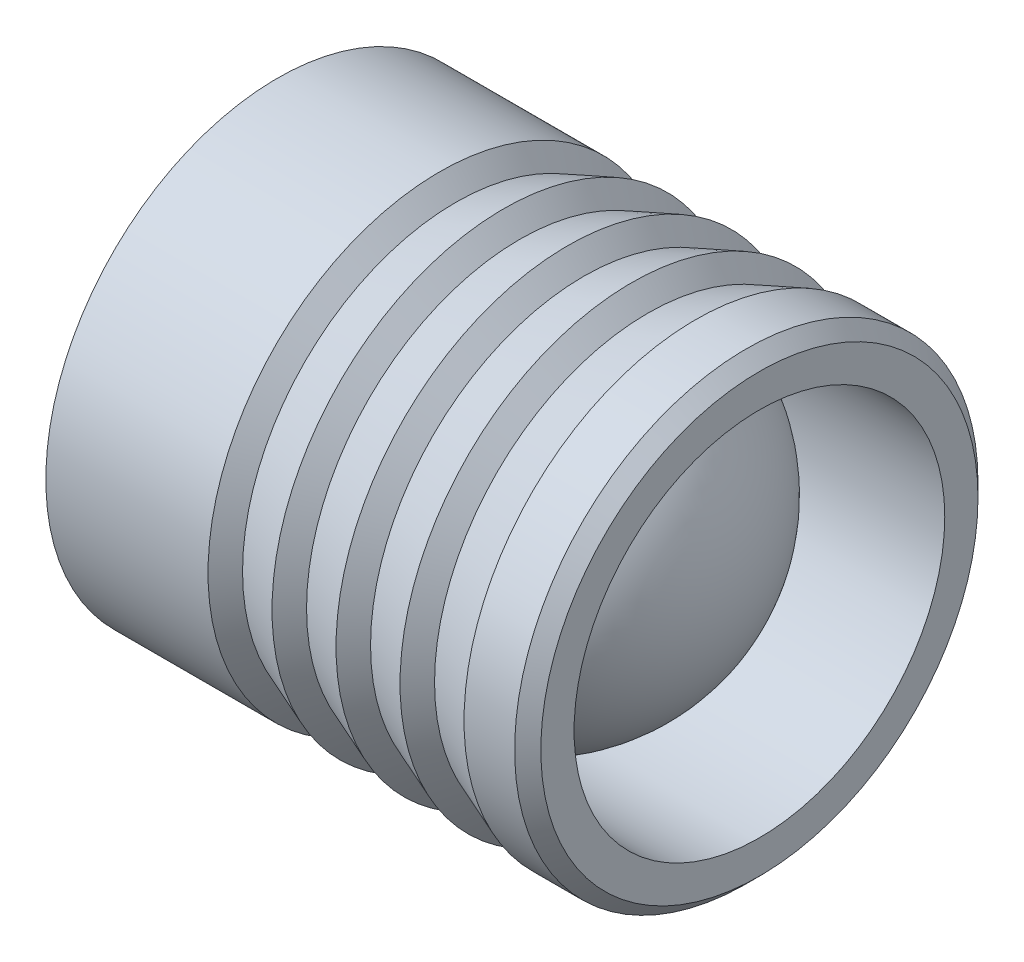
ISO-10303-21;
HEADER;
FILE_DESCRIPTION(('STEP AP214'),'2;1');
FILE_NAME('part.step','',(''),(''),'','','');
FILE_SCHEMA(('AUTOMOTIVE_DESIGN { 1 0 10303 214 1 1 1 1 }'));
ENDSEC;
DATA;
#1=APPLICATION_CONTEXT('core data for automotive mechanical design processes');
#2=APPLICATION_PROTOCOL_DEFINITION('international standard','automotive_design',2000,#1);
#3=PRODUCT_CONTEXT('',#1,'mechanical');
#4=PRODUCT('Part','Part','',(#3));
#5=PRODUCT_RELATED_PRODUCT_CATEGORY('part','',(#4));
#6=PRODUCT_DEFINITION_FORMATION('','',#4);
#7=PRODUCT_DEFINITION_CONTEXT('part definition',#1,'design');
#8=PRODUCT_DEFINITION('design','',#6,#7);
#9=PRODUCT_DEFINITION_SHAPE('','',#8);
#10=(LENGTH_UNIT() NAMED_UNIT(*) SI_UNIT(.MILLI.,.METRE.));
#11=(NAMED_UNIT(*) PLANE_ANGLE_UNIT() SI_UNIT($,.RADIAN.));
#12=(NAMED_UNIT(*) SI_UNIT($,.STERADIAN.) SOLID_ANGLE_UNIT());
#13=UNCERTAINTY_MEASURE_WITH_UNIT(LENGTH_MEASURE(1.E-05),#10,'distance_accuracy_value','');
#14=(GEOMETRIC_REPRESENTATION_CONTEXT(3) GLOBAL_UNCERTAINTY_ASSIGNED_CONTEXT((#13)) GLOBAL_UNIT_ASSIGNED_CONTEXT((#10,
#11,#12)) REPRESENTATION_CONTEXT('',''));
#15=CARTESIAN_POINT('',(0.,0.,0.));
#16=DIRECTION('',(0.,0.,1.));
#17=DIRECTION('',(1.,0.,0.));
#18=AXIS2_PLACEMENT_3D('',#15,#16,#17);
#19=CARTESIAN_POINT('',(3.09,0.,0.));
#20=DIRECTION('',(1.,0.,0.));
#21=DIRECTION('',(0.,-1.,0.));
#22=AXIS2_PLACEMENT_3D('',#19,#20,#21);
#23=SPHERICAL_SURFACE('',#22,2.01);
#24=CARTESIAN_POINT('',(3.29025084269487,0.,0.));
#25=DIRECTION('',(-1.,0.,0.));
#26=DIRECTION('',(0.,0.,1.));
#27=AXIS2_PLACEMENT_3D('',#24,#25,#26);
#28=CIRCLE('',#27,1.9999999);
#29=CARTESIAN_POINT('',(3.29025084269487,0.,1.9999999));
#30=VERTEX_POINT('',#29);
#31=EDGE_CURVE('E41',#30,#30,#28,.T.);
#32=ORIENTED_EDGE('',*,*,#31,.F.);
#33=EDGE_LOOP('',(#32));
#34=FACE_BOUND('',#33,.T.);
#35=CARTESIAN_POINT('',(5.1,0.,0.));
#36=VERTEX_POINT('',#35);
#37=VERTEX_LOOP('',#36);
#38=FACE_BOUND('',#37,.T.);
#39=ADVANCED_FACE('F18',(#34,#38),#23,.T.);
#40=CARTESIAN_POINT('',(5.5,2.35857864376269,0.));
#41=DIRECTION('',(-1.,0.,0.));
#42=DIRECTION('',(0.,0.,1.));
#43=AXIS2_PLACEMENT_3D('',#40,#41,#42);
#44=PLANE('',#43);
#45=CARTESIAN_POINT('',(5.5,0.,0.));
#46=DIRECTION('',(1.,0.,0.));
#47=DIRECTION('',(0.,0.,-1.));
#48=AXIS2_PLACEMENT_3D('',#45,#46,#47);
#49=CIRCLE('',#48,2.3585786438);
#50=CARTESIAN_POINT('',(5.5,0.,-2.35857864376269));
#51=VERTEX_POINT('',#50);
#52=EDGE_CURVE('E11',#51,#51,#49,.T.);
#53=ORIENTED_EDGE('',*,*,#52,.T.);
#54=EDGE_LOOP('',(#53));
#55=FACE_BOUND('',#54,.T.);
#56=CARTESIAN_POINT('',(5.5,0.,0.));
#57=DIRECTION('',(1.,0.,0.));
#58=DIRECTION('',(0.,0.,-1.));
#59=AXIS2_PLACEMENT_3D('',#56,#57,#58);
#60=CIRCLE('',#59,1.9999999);
#61=CARTESIAN_POINT('',(5.5,0.,-1.99999989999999));
#62=VERTEX_POINT('',#61);
#63=EDGE_CURVE('E29',#62,#62,#60,.T.);
#64=ORIENTED_EDGE('',*,*,#63,.F.);
#65=EDGE_LOOP('',(#64));
#66=FACE_BOUND('',#65,.T.);
#67=ADVANCED_FACE('F150',(#55,#66),#44,.F.);
#68=CARTESIAN_POINT('',(5.5,0.,0.));
#69=DIRECTION('',(-1.,0.,0.));
#70=DIRECTION('',(0.,0.,-1.));
#71=AXIS2_PLACEMENT_3D('',#68,#69,#70);
#72=CYLINDRICAL_SURFACE('',#71,1.9999999);
#73=ORIENTED_EDGE('',*,*,#63,.T.);
#74=EDGE_LOOP('',(#73));
#75=FACE_BOUND('',#74,.T.);
#76=ORIENTED_EDGE('',*,*,#31,.T.);
#77=EDGE_LOOP('',(#76));
#78=FACE_BOUND('',#77,.T.);
#79=ADVANCED_FACE('F141',(#75,#78),#72,.F.);
#80=CARTESIAN_POINT('',(0.,0.,0.));
#81=DIRECTION('',(1.,0.,0.));
#82=DIRECTION('',(0.,1.,0.));
#83=AXIS2_PLACEMENT_3D('',#80,#81,#82);
#84=PLANE('',#83);
#85=CARTESIAN_POINT('',(0.,0.,0.));
#86=DIRECTION('',(1.,0.,0.));
#87=DIRECTION('',(0.,0.,-1.));
#88=AXIS2_PLACEMENT_3D('',#85,#86,#87);
#89=CIRCLE('',#88,1.9803847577);
#90=CARTESIAN_POINT('',(0.,0.,-1.98038475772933));
#91=VERTEX_POINT('',#90);
#92=EDGE_CURVE('E235',#91,#91,#89,.T.);
#93=ORIENTED_EDGE('',*,*,#92,.F.);
#94=EDGE_LOOP('',(#93));
#95=FACE_BOUND('',#94,.T.);
#96=ADVANCED_FACE('F138',(#95),#84,.F.);
#97=CARTESIAN_POINT('',(5.35857864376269,0.,0.));
#98=DIRECTION('',(-1.,0.,0.));
#99=DIRECTION('',(0.,0.,1.));
#100=AXIS2_PLACEMENT_3D('',#97,#98,#99);
#101=CONICAL_SURFACE('',#100,2.5,0.7853981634);
#102=CARTESIAN_POINT('',(5.35857864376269,0.,0.));
#103=DIRECTION('',(1.,0.,0.));
#104=DIRECTION('',(0.,0.,-1.));
#105=AXIS2_PLACEMENT_3D('',#102,#103,#104);
#106=CIRCLE('',#105,2.5);
#107=CARTESIAN_POINT('',(5.35857864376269,0.,-2.5));
#108=VERTEX_POINT('',#107);
#109=EDGE_CURVE('E202',#108,#108,#106,.T.);
#110=ORIENTED_EDGE('',*,*,#109,.T.);
#111=EDGE_LOOP('',(#110));
#112=FACE_BOUND('',#111,.T.);
#113=ORIENTED_EDGE('',*,*,#52,.F.);
#114=EDGE_LOOP('',(#113));
#115=FACE_BOUND('',#114,.T.);
#116=ADVANCED_FACE('F140',(#112,#115),#101,.T.);
#117=CARTESIAN_POINT('',(5.5,0.,0.));
#118=DIRECTION('',(-1.,0.,0.));
#119=DIRECTION('',(0.,0.,-1.));
#120=AXIS2_PLACEMENT_3D('',#117,#118,#119);
#121=CYLINDRICAL_SURFACE('',#120,2.5);
#122=CARTESIAN_POINT('',(4.8125,0.,0.));
#123=DIRECTION('',(1.,0.,0.));
#124=DIRECTION('',(0.,0.,-1.));
#125=AXIS2_PLACEMENT_3D('',#122,#123,#124);
#126=CIRCLE('',#125,2.5);
#127=CARTESIAN_POINT('',(4.8125,0.,-2.5));
#128=VERTEX_POINT('',#127);
#129=EDGE_CURVE('E200',#128,#128,#126,.T.);
#130=ORIENTED_EDGE('',*,*,#129,.T.);
#131=EDGE_LOOP('',(#130));
#132=FACE_BOUND('',#131,.T.);
#133=ORIENTED_EDGE('',*,*,#109,.F.);
#134=EDGE_LOOP('',(#133));
#135=FACE_BOUND('',#134,.T.);
#136=ADVANCED_FACE('F147',(#132,#135),#121,.T.);
#137=CARTESIAN_POINT('',(4.29453125,0.,0.));
#138=DIRECTION('',(1.,0.,0.));
#139=DIRECTION('',(0.,0.,-1.));
#140=AXIS2_PLACEMENT_3D('',#137,#138,#139);
#141=CONICAL_SURFACE('',#140,2.3,0.368487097);
#142=ORIENTED_EDGE('',*,*,#129,.F.);
#143=EDGE_LOOP('',(#142));
#144=FACE_BOUND('',#143,.T.);
#145=CARTESIAN_POINT('',(4.29453125,0.,0.));
#146=DIRECTION('',(1.,0.,0.));
#147=DIRECTION('',(0.,0.,-1.));
#148=AXIS2_PLACEMENT_3D('',#145,#146,#147);
#149=CIRCLE('',#148,2.3);
#150=CARTESIAN_POINT('',(4.29453125,0.,-2.3));
#151=VERTEX_POINT('',#150);
#152=EDGE_CURVE('E210',#151,#151,#149,.T.);
#153=ORIENTED_EDGE('',*,*,#152,.T.);
#154=EDGE_LOOP('',(#153));
#155=FACE_BOUND('',#154,.T.);
#156=ADVANCED_FACE('F179',(#144,#155),#141,.T.);
#157=CARTESIAN_POINT('',(4.121875,0.,0.));
#158=DIRECTION('',(-1.,0.,0.));
#159=DIRECTION('',(0.,0.,1.));
#160=AXIS2_PLACEMENT_3D('',#157,#158,#159);
#161=CONICAL_SURFACE('',#160,2.5,0.8586421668);
#162=CARTESIAN_POINT('',(4.121875,0.,0.));
#163=DIRECTION('',(1.,0.,0.));
#164=DIRECTION('',(0.,0.,-1.));
#165=AXIS2_PLACEMENT_3D('',#162,#163,#164);
#166=CIRCLE('',#165,2.5);
#167=CARTESIAN_POINT('',(4.121875,0.,-2.5));
#168=VERTEX_POINT('',#167);
#169=EDGE_CURVE('E88',#168,#168,#166,.T.);
#170=ORIENTED_EDGE('',*,*,#169,.T.);
#171=EDGE_LOOP('',(#170));
#172=FACE_BOUND('',#171,.T.);
#173=ORIENTED_EDGE('',*,*,#152,.F.);
#174=EDGE_LOOP('',(#173));
#175=FACE_BOUND('',#174,.T.);
#176=ADVANCED_FACE('F176',(#172,#175),#161,.T.);
#177=CARTESIAN_POINT('',(3.60390625,0.,0.));
#178=DIRECTION('',(1.,0.,0.));
#179=DIRECTION('',(0.,0.,-1.));
#180=AXIS2_PLACEMENT_3D('',#177,#178,#179);
#181=CONICAL_SURFACE('',#180,2.3,0.368487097);
#182=ORIENTED_EDGE('',*,*,#169,.F.);
#183=EDGE_LOOP('',(#182));
#184=FACE_BOUND('',#183,.T.);
#185=CARTESIAN_POINT('',(3.60390625,0.,0.));
#186=DIRECTION('',(1.,0.,0.));
#187=DIRECTION('',(0.,0.,-1.));
#188=AXIS2_PLACEMENT_3D('',#185,#186,#187);
#189=CIRCLE('',#188,2.3);
#190=CARTESIAN_POINT('',(3.60390625,0.,-2.3));
#191=VERTEX_POINT('',#190);
#192=EDGE_CURVE('E95',#191,#191,#189,.T.);
#193=ORIENTED_EDGE('',*,*,#192,.T.);
#194=EDGE_LOOP('',(#193));
#195=FACE_BOUND('',#194,.T.);
#196=ADVANCED_FACE('F136',(#184,#195),#181,.T.);
#197=CARTESIAN_POINT('',(3.43125,0.,0.));
#198=DIRECTION('',(-1.,0.,0.));
#199=DIRECTION('',(0.,0.,1.));
#200=AXIS2_PLACEMENT_3D('',#197,#198,#199);
#201=CONICAL_SURFACE('',#200,2.5,0.8586421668);
#202=CARTESIAN_POINT('',(3.43125,0.,0.));
#203=DIRECTION('',(1.,0.,0.));
#204=DIRECTION('',(0.,0.,-1.));
#205=AXIS2_PLACEMENT_3D('',#202,#203,#204);
#206=CIRCLE('',#205,2.5);
#207=CARTESIAN_POINT('',(3.43125,0.,-2.5));
#208=VERTEX_POINT('',#207);
#209=EDGE_CURVE('E105',#208,#208,#206,.T.);
#210=ORIENTED_EDGE('',*,*,#209,.T.);
#211=EDGE_LOOP('',(#210));
#212=FACE_BOUND('',#211,.T.);
#213=ORIENTED_EDGE('',*,*,#192,.F.);
#214=EDGE_LOOP('',(#213));
#215=FACE_BOUND('',#214,.T.);
#216=ADVANCED_FACE('F175',(#212,#215),#201,.T.);
#217=CARTESIAN_POINT('',(2.91328125,0.,0.));
#218=DIRECTION('',(1.,0.,0.));
#219=DIRECTION('',(0.,0.,-1.));
#220=AXIS2_PLACEMENT_3D('',#217,#218,#219);
#221=CONICAL_SURFACE('',#220,2.3,0.368487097);
#222=ORIENTED_EDGE('',*,*,#209,.F.);
#223=EDGE_LOOP('',(#222));
#224=FACE_BOUND('',#223,.T.);
#225=CARTESIAN_POINT('',(2.91328125,0.,0.));
#226=DIRECTION('',(1.,0.,0.));
#227=DIRECTION('',(0.,0.,-1.));
#228=AXIS2_PLACEMENT_3D('',#225,#226,#227);
#229=CIRCLE('',#228,2.3);
#230=CARTESIAN_POINT('',(2.91328125,0.,-2.3));
#231=VERTEX_POINT('',#230);
#232=EDGE_CURVE('E221',#231,#231,#229,.T.);
#233=ORIENTED_EDGE('',*,*,#232,.T.);
#234=EDGE_LOOP('',(#233));
#235=FACE_BOUND('',#234,.T.);
#236=ADVANCED_FACE('F171',(#224,#235),#221,.T.);
#237=CARTESIAN_POINT('',(2.740625,0.,0.));
#238=DIRECTION('',(-1.,0.,0.));
#239=DIRECTION('',(0.,0.,1.));
#240=AXIS2_PLACEMENT_3D('',#237,#238,#239);
#241=CONICAL_SURFACE('',#240,2.5,0.8586421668);
#242=CARTESIAN_POINT('',(2.740625,0.,0.));
#243=DIRECTION('',(1.,0.,0.));
#244=DIRECTION('',(0.,0.,-1.));
#245=AXIS2_PLACEMENT_3D('',#242,#243,#244);
#246=CIRCLE('',#245,2.5);
#247=CARTESIAN_POINT('',(2.740625,0.,-2.5));
#248=VERTEX_POINT('',#247);
#249=EDGE_CURVE('E225',#248,#248,#246,.T.);
#250=ORIENTED_EDGE('',*,*,#249,.T.);
#251=EDGE_LOOP('',(#250));
#252=FACE_BOUND('',#251,.T.);
#253=ORIENTED_EDGE('',*,*,#232,.F.);
#254=EDGE_LOOP('',(#253));
#255=FACE_BOUND('',#254,.T.);
#256=ADVANCED_FACE('F174',(#252,#255),#241,.T.);
#257=CARTESIAN_POINT('',(2.22265625,0.,0.));
#258=DIRECTION('',(1.,0.,0.));
#259=DIRECTION('',(0.,0.,-1.));
#260=AXIS2_PLACEMENT_3D('',#257,#258,#259);
#261=CONICAL_SURFACE('',#260,2.3,0.368487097);
#262=ORIENTED_EDGE('',*,*,#249,.F.);
#263=EDGE_LOOP('',(#262));
#264=FACE_BOUND('',#263,.T.);
#265=CARTESIAN_POINT('',(2.22265625,0.,0.));
#266=DIRECTION('',(1.,0.,0.));
#267=DIRECTION('',(0.,0.,-1.));
#268=AXIS2_PLACEMENT_3D('',#265,#266,#267);
#269=CIRCLE('',#268,2.3);
#270=CARTESIAN_POINT('',(2.22265625,0.,-2.3));
#271=VERTEX_POINT('',#270);
#272=EDGE_CURVE('E22',#271,#271,#269,.T.);
#273=ORIENTED_EDGE('',*,*,#272,.T.);
#274=EDGE_LOOP('',(#273));
#275=FACE_BOUND('',#274,.T.);
#276=ADVANCED_FACE('F169',(#264,#275),#261,.T.);
#277=CARTESIAN_POINT('',(2.05,0.,0.));
#278=DIRECTION('',(-1.,0.,0.));
#279=DIRECTION('',(0.,0.,1.));
#280=AXIS2_PLACEMENT_3D('',#277,#278,#279);
#281=CONICAL_SURFACE('',#280,2.5,0.8586421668);
#282=CARTESIAN_POINT('',(2.05,0.,0.));
#283=DIRECTION('',(1.,0.,0.));
#284=DIRECTION('',(0.,0.,-1.));
#285=AXIS2_PLACEMENT_3D('',#282,#283,#284);
#286=CIRCLE('',#285,2.5);
#287=CARTESIAN_POINT('',(2.05,0.,-2.5));
#288=VERTEX_POINT('',#287);
#289=EDGE_CURVE('E226',#288,#288,#286,.T.);
#290=ORIENTED_EDGE('',*,*,#289,.T.);
#291=EDGE_LOOP('',(#290));
#292=FACE_BOUND('',#291,.T.);
#293=ORIENTED_EDGE('',*,*,#272,.F.);
#294=EDGE_LOOP('',(#293));
#295=FACE_BOUND('',#294,.T.);
#296=ADVANCED_FACE('F166',(#292,#295),#281,.T.);
#297=CARTESIAN_POINT('',(5.5,0.,0.));
#298=DIRECTION('',(-1.,0.,0.));
#299=DIRECTION('',(0.,0.,-1.));
#300=AXIS2_PLACEMENT_3D('',#297,#298,#299);
#301=CYLINDRICAL_SURFACE('',#300,2.5);
#302=CARTESIAN_POINT('',(0.3,0.,0.));
#303=DIRECTION('',(1.,0.,0.));
#304=DIRECTION('',(0.,0.,-1.));
#305=AXIS2_PLACEMENT_3D('',#302,#303,#304);
#306=CIRCLE('',#305,2.5);
#307=CARTESIAN_POINT('',(0.3,0.,-2.5));
#308=VERTEX_POINT('',#307);
#309=EDGE_CURVE('E230',#308,#308,#306,.T.);
#310=ORIENTED_EDGE('',*,*,#309,.T.);
#311=EDGE_LOOP('',(#310));
#312=FACE_BOUND('',#311,.T.);
#313=ORIENTED_EDGE('',*,*,#289,.F.);
#314=EDGE_LOOP('',(#313));
#315=FACE_BOUND('',#314,.T.);
#316=ADVANCED_FACE('F20',(#312,#315),#301,.T.);
#317=CARTESIAN_POINT('',(0.,0.,0.));
#318=DIRECTION('',(1.,0.,0.));
#319=DIRECTION('',(0.,0.,-1.));
#320=AXIS2_PLACEMENT_3D('',#317,#318,#319);
#321=CONICAL_SURFACE('',#320,1.9803847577,1.0471975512);
#322=ORIENTED_EDGE('',*,*,#309,.F.);
#323=EDGE_LOOP('',(#322));
#324=FACE_BOUND('',#323,.T.);
#325=ORIENTED_EDGE('',*,*,#92,.T.);
#326=EDGE_LOOP('',(#325));
#327=FACE_BOUND('',#326,.T.);
#328=ADVANCED_FACE('F162',(#324,#327),#321,.T.);
#329=CLOSED_SHELL('',(#39,#67,#79,#96,#116,#136,#156,#176,#196,#216,#236,#256,#276,#296,#316,#328));
#330=CARTESIAN_POINT('',(1.42970048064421,0.,0.));
#331=DIRECTION('',(1.,0.,0.));
#332=DIRECTION('',(0.,0.,-1.));
#333=AXIS2_PLACEMENT_3D('',#330,#331,#332);
#334=CONICAL_SURFACE('',#333,1.9999999,1.0471975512);
#335=CARTESIAN_POINT('',(1.42970048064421,0.,0.));
#336=DIRECTION('',(1.,0.,0.));
#337=DIRECTION('',(0.,0.,-1.));
#338=AXIS2_PLACEMENT_3D('',#335,#336,#337);
#339=CIRCLE('',#338,1.9999999);
#340=CARTESIAN_POINT('',(1.42970048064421,0.,-1.9999999));
#341=VERTEX_POINT('',#340);
#342=EDGE_CURVE('E213',#341,#341,#339,.T.);
#343=ORIENTED_EDGE('',*,*,#342,.T.);
#344=EDGE_LOOP('',(#343));
#345=FACE_BOUND('',#344,.T.);
#346=CARTESIAN_POINT('',(0.275,0.,0.));
#347=VERTEX_POINT('',#346);
#348=VERTEX_LOOP('',#347);
#349=FACE_BOUND('',#348,.T.);
#350=ADVANCED_FACE('F122',(#345,#349),#334,.F.);
#351=CARTESIAN_POINT('',(3.09,0.,0.));
#352=DIRECTION('',(1.,0.,0.));
#353=DIRECTION('',(0.,-1.,0.));
#354=AXIS2_PLACEMENT_3D('',#351,#352,#353);
#355=SPHERICAL_SURFACE('',#354,2.01);
#356=CARTESIAN_POINT('',(2.88974915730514,0.,0.));
#357=DIRECTION('',(1.,0.,0.));
#358=DIRECTION('',(0.,0.,-1.));
#359=AXIS2_PLACEMENT_3D('',#356,#357,#358);
#360=CIRCLE('',#359,1.9999999);
#361=CARTESIAN_POINT('',(2.88974915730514,0.,-1.9999999));
#362=VERTEX_POINT('',#361);
#363=EDGE_CURVE('E114',#362,#362,#360,.T.);
#364=ORIENTED_EDGE('',*,*,#363,.F.);
#365=EDGE_LOOP('',(#364));
#366=FACE_BOUND('',#365,.T.);
#367=CARTESIAN_POINT('',(1.08,0.,0.));
#368=VERTEX_POINT('',#367);
#369=VERTEX_LOOP('',#368);
#370=FACE_BOUND('',#369,.T.);
#371=ADVANCED_FACE('F119',(#366,#370),#355,.T.);
#372=CARTESIAN_POINT('',(5.5,0.,0.));
#373=DIRECTION('',(-1.,0.,0.));
#374=DIRECTION('',(0.,0.,-1.));
#375=AXIS2_PLACEMENT_3D('',#372,#373,#374);
#376=CYLINDRICAL_SURFACE('',#375,1.9999999);
#377=ORIENTED_EDGE('',*,*,#363,.T.);
#378=EDGE_LOOP('',(#377));
#379=FACE_BOUND('',#378,.T.);
#380=ORIENTED_EDGE('',*,*,#342,.F.);
#381=EDGE_LOOP('',(#380));
#382=FACE_BOUND('',#381,.T.);
#383=ADVANCED_FACE('F121',(#379,#382),#376,.F.);
#384=CLOSED_SHELL('',(#350,#371,#383));
#385=ORIENTED_CLOSED_SHELL('',*,#384,.T.);
#386=BREP_WITH_VOIDS('B1',#329,(#385));
#387=ADVANCED_BREP_SHAPE_REPRESENTATION('',(#18,#386),#14);
#388=SHAPE_DEFINITION_REPRESENTATION(#9,#387);
ENDSEC;
END-ISO-10303-21;
